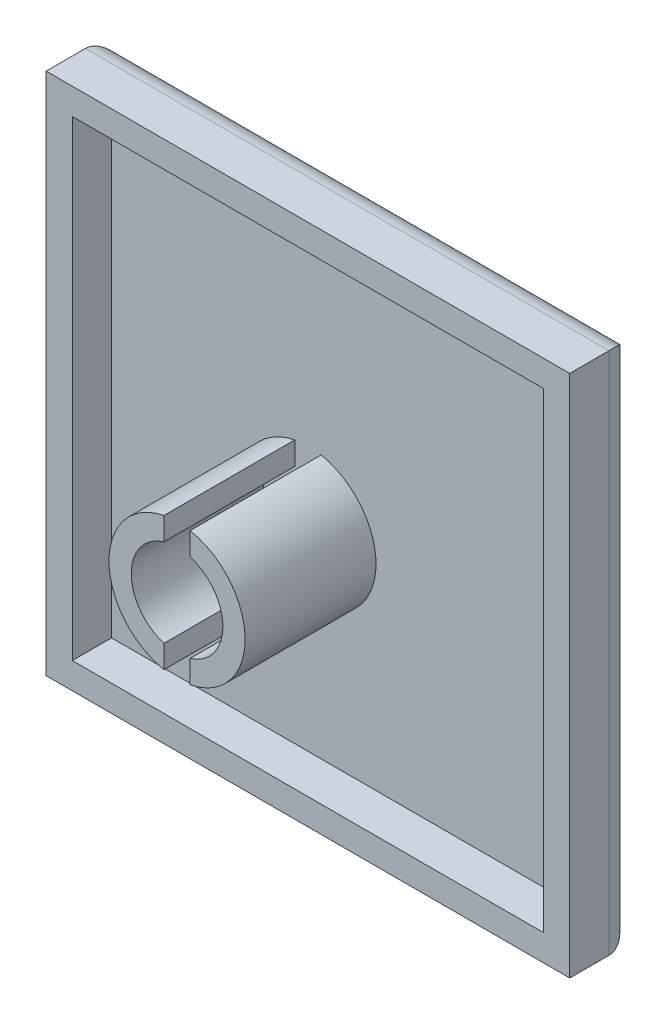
ISO-10303-21;
HEADER;
FILE_DESCRIPTION(('STEP AP214'),'2;1');
FILE_NAME('part.step','',(''),(''),'','','');
FILE_SCHEMA(('AUTOMOTIVE_DESIGN { 1 0 10303 214 1 1 1 1 }'));
ENDSEC;
DATA;
#1=APPLICATION_CONTEXT('core data for automotive mechanical design processes');
#2=APPLICATION_PROTOCOL_DEFINITION('international standard','automotive_design',2000,#1);
#3=PRODUCT_CONTEXT('',#1,'mechanical');
#4=PRODUCT('Part','Part','',(#3));
#5=PRODUCT_RELATED_PRODUCT_CATEGORY('part','',(#4));
#6=PRODUCT_DEFINITION_FORMATION('','',#4);
#7=PRODUCT_DEFINITION_CONTEXT('part definition',#1,'design');
#8=PRODUCT_DEFINITION('design','',#6,#7);
#9=PRODUCT_DEFINITION_SHAPE('','',#8);
#10=(LENGTH_UNIT() NAMED_UNIT(*) SI_UNIT(.MILLI.,.METRE.));
#11=(NAMED_UNIT(*) PLANE_ANGLE_UNIT() SI_UNIT($,.RADIAN.));
#12=(NAMED_UNIT(*) SI_UNIT($,.STERADIAN.) SOLID_ANGLE_UNIT());
#13=UNCERTAINTY_MEASURE_WITH_UNIT(LENGTH_MEASURE(1.E-05),#10,'distance_accuracy_value','');
#14=(GEOMETRIC_REPRESENTATION_CONTEXT(3) GLOBAL_UNCERTAINTY_ASSIGNED_CONTEXT((#13)) GLOBAL_UNIT_ASSIGNED_CONTEXT((#10,
#11,#12)) REPRESENTATION_CONTEXT('',''));
#15=CARTESIAN_POINT('',(0.,0.,0.));
#16=DIRECTION('',(0.,0.,1.));
#17=DIRECTION('',(1.,0.,0.));
#18=AXIS2_PLACEMENT_3D('',#15,#16,#17);
#19=CARTESIAN_POINT('',(0.,0.,6.25));
#20=DIRECTION('',(0.,0.,1.));
#21=DIRECTION('',(1.,0.,0.));
#22=AXIS2_PLACEMENT_3D('',#19,#20,#21);
#23=PLANE('',#22);
#24=DIRECTION('',(0.,-1.,0.));
#25=VECTOR('',#24,1.);
#26=CARTESIAN_POINT('',(-0.500000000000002,10.,6.25));
#27=LINE('',#26,#25);
#28=CARTESIAN_POINT('',(-0.500000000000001,2.55147016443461,6.25));
#29=VERTEX_POINT('',#28);
#30=CARTESIAN_POINT('',(-0.500000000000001,1.67705098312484,6.25));
#31=VERTEX_POINT('',#30);
#32=EDGE_CURVE('E55',#29,#31,#27,.T.);
#33=ORIENTED_EDGE('',*,*,#32,.F.);
#34=CARTESIAN_POINT('',(0.,0.,6.25));
#35=DIRECTION('',(0.,0.,1.));
#36=DIRECTION('',(1.,0.,0.));
#37=AXIS2_PLACEMENT_3D('',#34,#35,#36);
#38=CIRCLE('',#37,2.6);
#39=CARTESIAN_POINT('',(-0.5,-2.55147016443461,6.25));
#40=VERTEX_POINT('',#39);
#41=EDGE_CURVE('E100',#29,#40,#38,.T.);
#42=ORIENTED_EDGE('',*,*,#41,.T.);
#43=CARTESIAN_POINT('',(-0.500000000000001,-1.67705098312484,6.25));
#44=VERTEX_POINT('',#43);
#45=EDGE_CURVE('E13',#44,#40,#27,.T.);
#46=ORIENTED_EDGE('',*,*,#45,.F.);
#47=CARTESIAN_POINT('',(0.,0.,6.25));
#48=DIRECTION('',(0.,0.,1.));
#49=DIRECTION('',(1.,0.,0.));
#50=AXIS2_PLACEMENT_3D('',#47,#48,#49);
#51=CIRCLE('',#50,1.75);
#52=EDGE_CURVE('E49',#31,#44,#51,.T.);
#53=ORIENTED_EDGE('',*,*,#52,.F.);
#54=EDGE_LOOP('',(#33,#42,#46,#53));
#55=FACE_BOUND('',#54,.T.);
#56=ADVANCED_FACE('F46',(#55),#23,.T.);
#57=CARTESIAN_POINT('',(0.,0.,6.25));
#58=DIRECTION('',(0.,0.,-1.));
#59=DIRECTION('',(-1.,0.,0.));
#60=AXIS2_PLACEMENT_3D('',#57,#58,#59);
#61=CYLINDRICAL_SURFACE('',#60,2.6);
#62=ORIENTED_EDGE('',*,*,#41,.F.);
#63=DIRECTION('',(0.,0.,-1.));
#64=VECTOR('',#63,1.);
#65=CARTESIAN_POINT('',(-0.500000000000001,2.55147016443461,6.25));
#66=LINE('',#65,#64);
#67=CARTESIAN_POINT('',(-0.5,2.55147016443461,1.25));
#68=VERTEX_POINT('',#67);
#69=EDGE_CURVE('E111',#29,#68,#66,.T.);
#70=ORIENTED_EDGE('',*,*,#69,.T.);
#71=CARTESIAN_POINT('',(0.,0.,1.25));
#72=DIRECTION('',(0.,0.,1.));
#73=DIRECTION('',(1.,0.,0.));
#74=AXIS2_PLACEMENT_3D('',#71,#72,#73);
#75=CIRCLE('',#74,2.6);
#76=CARTESIAN_POINT('',(-0.5,-2.55147016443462,1.25));
#77=VERTEX_POINT('',#76);
#78=EDGE_CURVE('E112',#68,#77,#75,.T.);
#79=ORIENTED_EDGE('',*,*,#78,.T.);
#80=DIRECTION('',(0.,0.,-1.));
#81=VECTOR('',#80,1.);
#82=CARTESIAN_POINT('',(-0.5,-2.55147016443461,6.25));
#83=LINE('',#82,#81);
#84=EDGE_CURVE('E63',#77,#40,#83,.F.);
#85=ORIENTED_EDGE('',*,*,#84,.T.);
#86=EDGE_LOOP('',(#62,#70,#79,#85));
#87=FACE_BOUND('',#86,.T.);
#88=ADVANCED_FACE('F116',(#87),#61,.T.);
#89=CARTESIAN_POINT('',(0.,0.,1.25));
#90=DIRECTION('',(0.,0.,1.));
#91=DIRECTION('',(1.,0.,0.));
#92=AXIS2_PLACEMENT_3D('',#89,#90,#91);
#93=PLANE('',#92);
#94=ORIENTED_EDGE('',*,*,#78,.F.);
#95=DIRECTION('',(0.,-1.,0.));
#96=VECTOR('',#95,1.);
#97=CARTESIAN_POINT('',(-0.500000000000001,10.,1.25));
#98=LINE('',#97,#96);
#99=CARTESIAN_POINT('',(-0.5,1.67705098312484,1.25));
#100=VERTEX_POINT('',#99);
#101=EDGE_CURVE('E102',#68,#100,#98,.T.);
#102=ORIENTED_EDGE('',*,*,#101,.T.);
#103=CARTESIAN_POINT('',(0.,0.,1.25));
#104=DIRECTION('',(0.,0.,1.));
#105=DIRECTION('',(1.,0.,0.));
#106=AXIS2_PLACEMENT_3D('',#103,#104,#105);
#107=CIRCLE('',#106,1.75);
#108=CARTESIAN_POINT('',(-0.5,-1.67705098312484,1.25));
#109=VERTEX_POINT('',#108);
#110=EDGE_CURVE('E94',#109,#100,#107,.F.);
#111=ORIENTED_EDGE('',*,*,#110,.F.);
#112=EDGE_CURVE('E89',#109,#77,#98,.T.);
#113=ORIENTED_EDGE('',*,*,#112,.T.);
#114=EDGE_LOOP('',(#94,#102,#111,#113));
#115=FACE_BOUND('',#114,.T.);
#116=ADVANCED_FACE('F117',(#115),#93,.F.);
#117=CARTESIAN_POINT('',(0.,0.,-5.19974746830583));
#118=DIRECTION('',(0.,0.,1.));
#119=DIRECTION('',(1.,0.,0.));
#120=AXIS2_PLACEMENT_3D('',#117,#118,#119);
#121=CYLINDRICAL_SURFACE('',#120,1.75);
#122=ORIENTED_EDGE('',*,*,#52,.T.);
#123=DIRECTION('',(0.,0.,1.));
#124=VECTOR('',#123,1.);
#125=CARTESIAN_POINT('',(-0.499999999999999,-1.67705098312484,-5.19974746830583));
#126=LINE('',#125,#124);
#127=EDGE_CURVE('E86',#44,#109,#126,.F.);
#128=ORIENTED_EDGE('',*,*,#127,.T.);
#129=ORIENTED_EDGE('',*,*,#110,.T.);
#130=DIRECTION('',(0.,0.,1.));
#131=VECTOR('',#130,1.);
#132=CARTESIAN_POINT('',(-0.499999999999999,1.67705098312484,-5.19974746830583));
#133=LINE('',#132,#131);
#134=EDGE_CURVE('E77',#100,#31,#133,.T.);
#135=ORIENTED_EDGE('',*,*,#134,.T.);
#136=EDGE_LOOP('',(#122,#128,#129,#135));
#137=FACE_BOUND('',#136,.T.);
#138=ADVANCED_FACE('F101',(#137),#121,.F.);
#139=CARTESIAN_POINT('',(-0.500000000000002,10.,6.25));
#140=DIRECTION('',(-1.,0.,0.));
#141=DIRECTION('',(0.,0.,1.));
#142=AXIS2_PLACEMENT_3D('',#139,#140,#141);
#143=PLANE('',#142);
#144=ORIENTED_EDGE('',*,*,#32,.T.);
#145=ORIENTED_EDGE('',*,*,#134,.F.);
#146=ORIENTED_EDGE('',*,*,#101,.F.);
#147=ORIENTED_EDGE('',*,*,#69,.F.);
#148=EDGE_LOOP('',(#144,#145,#146,#147));
#149=FACE_BOUND('',#148,.T.);
#150=ADVANCED_FACE('F118',(#149),#143,.F.);
#151=ORIENTED_EDGE('',*,*,#112,.F.);
#152=ORIENTED_EDGE('',*,*,#127,.F.);
#153=ORIENTED_EDGE('',*,*,#45,.T.);
#154=ORIENTED_EDGE('',*,*,#84,.F.);
#155=EDGE_LOOP('',(#151,#152,#153,#154));
#156=FACE_BOUND('',#155,.T.);
#157=ADVANCED_FACE('F88',(#156),#143,.F.);
#158=CLOSED_SHELL('',(#56,#88,#116,#138,#150,#157));
#159=MANIFOLD_SOLID_BREP('B2',#158);
#160=CARTESIAN_POINT('',(0.,0.,1.25));
#161=DIRECTION('',(0.,0.,1.));
#162=DIRECTION('',(1.,0.,0.));
#163=AXIS2_PLACEMENT_3D('',#160,#161,#162);
#164=PLANE('',#163);
#165=DIRECTION('',(0.,-1.,0.));
#166=VECTOR('',#165,1.);
#167=CARTESIAN_POINT('',(-9.,9.00000000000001,1.25));
#168=LINE('',#167,#166);
#169=CARTESIAN_POINT('',(-9.,9.00000000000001,1.25));
#170=VERTEX_POINT('',#169);
#171=CARTESIAN_POINT('',(-9.,-8.99999999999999,1.25));
#172=VERTEX_POINT('',#171);
#173=EDGE_CURVE('E254',#170,#172,#168,.T.);
#174=ORIENTED_EDGE('',*,*,#173,.F.);
#175=DIRECTION('',(-1.,0.,0.));
#176=VECTOR('',#175,1.);
#177=CARTESIAN_POINT('',(-9.,9.00000000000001,1.25));
#178=LINE('',#177,#176);
#179=CARTESIAN_POINT('',(9.,9.00000000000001,1.25));
#180=VERTEX_POINT('',#179);
#181=EDGE_CURVE('E286',#180,#170,#178,.T.);
#182=ORIENTED_EDGE('',*,*,#181,.F.);
#183=DIRECTION('',(0.,1.,0.));
#184=VECTOR('',#183,1.);
#185=CARTESIAN_POINT('',(9.,9.00000000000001,1.25));
#186=LINE('',#185,#184);
#187=CARTESIAN_POINT('',(9.,-8.99999999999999,1.25));
#188=VERTEX_POINT('',#187);
#189=EDGE_CURVE('E283',#188,#180,#186,.T.);
#190=ORIENTED_EDGE('',*,*,#189,.F.);
#191=DIRECTION('',(1.,0.,0.));
#192=VECTOR('',#191,1.);
#193=CARTESIAN_POINT('',(-9.,-8.99999999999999,1.25));
#194=LINE('',#193,#192);
#195=EDGE_CURVE('E262',#172,#188,#194,.T.);
#196=ORIENTED_EDGE('',*,*,#195,.F.);
#197=EDGE_LOOP('',(#174,#182,#190,#196));
#198=FACE_BOUND('',#197,.T.);
#199=DIRECTION('',(-1.,0.,0.));
#200=VECTOR('',#199,1.);
#201=CARTESIAN_POINT('',(-10.,10.,1.25));
#202=LINE('',#201,#200);
#203=CARTESIAN_POINT('',(10.,10.,1.25));
#204=VERTEX_POINT('',#203);
#205=CARTESIAN_POINT('',(-10.,10.,1.25));
#206=VERTEX_POINT('',#205);
#207=EDGE_CURVE('E181',#204,#206,#202,.T.);
#208=ORIENTED_EDGE('',*,*,#207,.T.);
#209=DIRECTION('',(0.,-1.,0.));
#210=VECTOR('',#209,1.);
#211=CARTESIAN_POINT('',(-10.,10.,1.25));
#212=LINE('',#211,#210);
#213=CARTESIAN_POINT('',(-10.,-9.99999999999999,1.25));
#214=VERTEX_POINT('',#213);
#215=EDGE_CURVE('E276',#206,#214,#212,.T.);
#216=ORIENTED_EDGE('',*,*,#215,.T.);
#217=DIRECTION('',(1.,0.,0.));
#218=VECTOR('',#217,1.);
#219=CARTESIAN_POINT('',(-10.,-9.99999999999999,1.25));
#220=LINE('',#219,#218);
#221=CARTESIAN_POINT('',(10.,-9.99999999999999,1.25));
#222=VERTEX_POINT('',#221);
#223=EDGE_CURVE('E273',#214,#222,#220,.T.);
#224=ORIENTED_EDGE('',*,*,#223,.T.);
#225=DIRECTION('',(0.,1.,0.));
#226=VECTOR('',#225,1.);
#227=CARTESIAN_POINT('',(10.,10.,1.25));
#228=LINE('',#227,#226);
#229=EDGE_CURVE('E275',#222,#204,#228,.T.);
#230=ORIENTED_EDGE('',*,*,#229,.T.);
#231=EDGE_LOOP('',(#208,#216,#224,#230));
#232=FACE_BOUND('',#231,.T.);
#233=ADVANCED_FACE('F177',(#198,#232),#164,.T.);
#234=CARTESIAN_POINT('',(-10.,10.,1.25));
#235=DIRECTION('',(1.,0.,0.));
#236=DIRECTION('',(0.,1.,0.));
#237=AXIS2_PLACEMENT_3D('',#234,#235,#236);
#238=PLANE('',#237);
#239=DIRECTION('',(0.,0.,-1.));
#240=VECTOR('',#239,1.);
#241=CARTESIAN_POINT('',(-10.,10.,1.25));
#242=LINE('',#241,#240);
#243=CARTESIAN_POINT('',(-10.,10.,-0.25));
#244=VERTEX_POINT('',#243);
#245=EDGE_CURVE('E390',#206,#244,#242,.T.);
#246=ORIENTED_EDGE('',*,*,#245,.T.);
#247=DIRECTION('',(0.,-1.,0.));
#248=VECTOR('',#247,1.);
#249=CARTESIAN_POINT('',(-10.,10.,-0.25));
#250=LINE('',#249,#248);
#251=CARTESIAN_POINT('',(-10.,-9.99999999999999,-0.25));
#252=VERTEX_POINT('',#251);
#253=EDGE_CURVE('E387',#244,#252,#250,.T.);
#254=ORIENTED_EDGE('',*,*,#253,.T.);
#255=DIRECTION('',(0.,0.,-1.));
#256=VECTOR('',#255,1.);
#257=CARTESIAN_POINT('',(-10.,-9.99999999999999,1.25));
#258=LINE('',#257,#256);
#259=EDGE_CURVE('E389',#214,#252,#258,.T.);
#260=ORIENTED_EDGE('',*,*,#259,.F.);
#261=ORIENTED_EDGE('',*,*,#215,.F.);
#262=EDGE_LOOP('',(#246,#254,#260,#261));
#263=FACE_BOUND('',#262,.T.);
#264=ADVANCED_FACE('F310',(#263),#238,.F.);
#265=CARTESIAN_POINT('',(-10.,-9.99999999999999,1.25));
#266=DIRECTION('',(0.,1.,0.));
#267=DIRECTION('',(-1.,0.,0.));
#268=AXIS2_PLACEMENT_3D('',#265,#266,#267);
#269=PLANE('',#268);
#270=ORIENTED_EDGE('',*,*,#259,.T.);
#271=DIRECTION('',(1.,0.,0.));
#272=VECTOR('',#271,1.);
#273=CARTESIAN_POINT('',(-10.,-9.99999999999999,-0.25));
#274=LINE('',#273,#272);
#275=CARTESIAN_POINT('',(10.,-9.99999999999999,-0.25));
#276=VERTEX_POINT('',#275);
#277=EDGE_CURVE('E398',#252,#276,#274,.T.);
#278=ORIENTED_EDGE('',*,*,#277,.T.);
#279=DIRECTION('',(0.,0.,-1.));
#280=VECTOR('',#279,1.);
#281=CARTESIAN_POINT('',(10.,-9.99999999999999,1.25));
#282=LINE('',#281,#280);
#283=EDGE_CURVE('E385',#222,#276,#282,.T.);
#284=ORIENTED_EDGE('',*,*,#283,.F.);
#285=ORIENTED_EDGE('',*,*,#223,.F.);
#286=EDGE_LOOP('',(#270,#278,#284,#285));
#287=FACE_BOUND('',#286,.T.);
#288=ADVANCED_FACE('F315',(#287),#269,.F.);
#289=CARTESIAN_POINT('',(10.,10.,1.25));
#290=DIRECTION('',(-1.,0.,0.));
#291=DIRECTION('',(0.,-1.,0.));
#292=AXIS2_PLACEMENT_3D('',#289,#290,#291);
#293=PLANE('',#292);
#294=ORIENTED_EDGE('',*,*,#283,.T.);
#295=DIRECTION('',(0.,1.,0.));
#296=VECTOR('',#295,1.);
#297=CARTESIAN_POINT('',(10.,10.,-0.25));
#298=LINE('',#297,#296);
#299=CARTESIAN_POINT('',(10.,10.,-0.25));
#300=VERTEX_POINT('',#299);
#301=EDGE_CURVE('E361',#276,#300,#298,.T.);
#302=ORIENTED_EDGE('',*,*,#301,.T.);
#303=DIRECTION('',(0.,0.,-1.));
#304=VECTOR('',#303,1.);
#305=CARTESIAN_POINT('',(10.,10.,1.25));
#306=LINE('',#305,#304);
#307=EDGE_CURVE('E355',#204,#300,#306,.T.);
#308=ORIENTED_EDGE('',*,*,#307,.F.);
#309=ORIENTED_EDGE('',*,*,#229,.F.);
#310=EDGE_LOOP('',(#294,#302,#308,#309));
#311=FACE_BOUND('',#310,.T.);
#312=ADVANCED_FACE('F340',(#311),#293,.F.);
#313=CARTESIAN_POINT('',(-10.,10.,1.25));
#314=DIRECTION('',(0.,-1.,0.));
#315=DIRECTION('',(1.,0.,0.));
#316=AXIS2_PLACEMENT_3D('',#313,#314,#315);
#317=PLANE('',#316);
#318=ORIENTED_EDGE('',*,*,#307,.T.);
#319=DIRECTION('',(-1.,0.,0.));
#320=VECTOR('',#319,1.);
#321=CARTESIAN_POINT('',(-10.,10.,-0.25));
#322=LINE('',#321,#320);
#323=EDGE_CURVE('E358',#300,#244,#322,.T.);
#324=ORIENTED_EDGE('',*,*,#323,.T.);
#325=ORIENTED_EDGE('',*,*,#245,.F.);
#326=ORIENTED_EDGE('',*,*,#207,.F.);
#327=EDGE_LOOP('',(#318,#324,#325,#326));
#328=FACE_BOUND('',#327,.T.);
#329=ADVANCED_FACE('F343',(#328),#317,.F.);
#330=CARTESIAN_POINT('',(0.,0.,-1.25));
#331=DIRECTION('',(0.,0.,1.));
#332=DIRECTION('',(1.,0.,0.));
#333=AXIS2_PLACEMENT_3D('',#330,#331,#332);
#334=PLANE('',#333);
#335=DIRECTION('',(0.,1.,0.));
#336=VECTOR('',#335,1.);
#337=CARTESIAN_POINT('',(9.,0.,-1.25));
#338=LINE('',#337,#336);
#339=CARTESIAN_POINT('',(9.,9.,-1.25));
#340=VERTEX_POINT('',#339);
#341=CARTESIAN_POINT('',(9.,-8.99999999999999,-1.25));
#342=VERTEX_POINT('',#341);
#343=EDGE_CURVE('E373',#340,#342,#338,.F.);
#344=ORIENTED_EDGE('',*,*,#343,.T.);
#345=DIRECTION('',(1.,0.,0.));
#346=VECTOR('',#345,1.);
#347=CARTESIAN_POINT('',(0.,-8.99999999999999,-1.25));
#348=LINE('',#347,#346);
#349=CARTESIAN_POINT('',(-9.,-8.99999999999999,-1.25));
#350=VERTEX_POINT('',#349);
#351=EDGE_CURVE('E391',#342,#350,#348,.F.);
#352=ORIENTED_EDGE('',*,*,#351,.T.);
#353=DIRECTION('',(0.,-1.,0.));
#354=VECTOR('',#353,1.);
#355=CARTESIAN_POINT('',(-9.,0.,-1.25));
#356=LINE('',#355,#354);
#357=CARTESIAN_POINT('',(-9.,9.00000000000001,-1.25));
#358=VERTEX_POINT('',#357);
#359=EDGE_CURVE('E394',#350,#358,#356,.F.);
#360=ORIENTED_EDGE('',*,*,#359,.T.);
#361=DIRECTION('',(-1.,0.,0.));
#362=VECTOR('',#361,1.);
#363=CARTESIAN_POINT('',(0.,9.,-1.25));
#364=LINE('',#363,#362);
#365=EDGE_CURVE('E381',#358,#340,#364,.F.);
#366=ORIENTED_EDGE('',*,*,#365,.T.);
#367=EDGE_LOOP('',(#344,#352,#360,#366));
#368=FACE_BOUND('',#367,.T.);
#369=ADVANCED_FACE('F320',(#368),#334,.F.);
#370=CARTESIAN_POINT('',(-10.,9.00000000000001,-0.25));
#371=DIRECTION('',(-1.,0.,0.));
#372=DIRECTION('',(0.,-1.,0.));
#373=AXIS2_PLACEMENT_3D('',#370,#371,#372);
#374=CYLINDRICAL_SURFACE('',#373,1.);
#375=CARTESIAN_POINT('',(9.,9.,-0.25));
#376=DIRECTION('',(-0.707106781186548,0.707106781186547,0.));
#377=DIRECTION('',(0.707106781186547,0.707106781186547,0.));
#378=AXIS2_PLACEMENT_3D('',#375,#376,#377);
#379=ELLIPSE('',#378,1.41421356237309,1.);
#380=EDGE_CURVE('E368',#340,#300,#379,.F.);
#381=ORIENTED_EDGE('',*,*,#380,.F.);
#382=ORIENTED_EDGE('',*,*,#365,.F.);
#383=CARTESIAN_POINT('',(-9.,9.00000000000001,-0.25));
#384=DIRECTION('',(-0.707106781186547,-0.707106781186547,0.));
#385=DIRECTION('',(-0.707106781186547,0.707106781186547,0.));
#386=AXIS2_PLACEMENT_3D('',#383,#384,#385);
#387=ELLIPSE('',#386,1.4142135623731,1.);
#388=EDGE_CURVE('E371',#244,#358,#387,.T.);
#389=ORIENTED_EDGE('',*,*,#388,.F.);
#390=ORIENTED_EDGE('',*,*,#323,.F.);
#391=EDGE_LOOP('',(#381,#382,#389,#390));
#392=FACE_BOUND('',#391,.T.);
#393=ADVANCED_FACE('F350',(#392),#374,.T.);
#394=CARTESIAN_POINT('',(-9.,10.,-0.25));
#395=DIRECTION('',(0.,-1.,0.));
#396=DIRECTION('',(1.,0.,0.));
#397=AXIS2_PLACEMENT_3D('',#394,#395,#396);
#398=CYLINDRICAL_SURFACE('',#397,1.);
#399=ORIENTED_EDGE('',*,*,#388,.T.);
#400=ORIENTED_EDGE('',*,*,#359,.F.);
#401=CARTESIAN_POINT('',(-9.,-8.99999999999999,-0.25));
#402=DIRECTION('',(0.707106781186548,-0.707106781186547,0.));
#403=DIRECTION('',(-0.707106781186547,-0.707106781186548,0.));
#404=AXIS2_PLACEMENT_3D('',#401,#402,#403);
#405=ELLIPSE('',#404,1.41421356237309,1.);
#406=EDGE_CURVE('E378',#252,#350,#405,.T.);
#407=ORIENTED_EDGE('',*,*,#406,.F.);
#408=ORIENTED_EDGE('',*,*,#253,.F.);
#409=EDGE_LOOP('',(#399,#400,#407,#408));
#410=FACE_BOUND('',#409,.T.);
#411=ADVANCED_FACE('F333',(#410),#398,.T.);
#412=CARTESIAN_POINT('',(9.,10.,-0.25));
#413=DIRECTION('',(0.,1.,0.));
#414=DIRECTION('',(-1.,0.,0.));
#415=AXIS2_PLACEMENT_3D('',#412,#413,#414);
#416=CYLINDRICAL_SURFACE('',#415,1.);
#417=ORIENTED_EDGE('',*,*,#380,.T.);
#418=ORIENTED_EDGE('',*,*,#301,.F.);
#419=CARTESIAN_POINT('',(9.,-8.99999999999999,-0.25));
#420=DIRECTION('',(0.707106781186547,0.707106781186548,0.));
#421=DIRECTION('',(-0.707106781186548,0.707106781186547,0.));
#422=AXIS2_PLACEMENT_3D('',#419,#420,#421);
#423=ELLIPSE('',#422,1.4142135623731,1.);
#424=EDGE_CURVE('E293',#342,#276,#423,.F.);
#425=ORIENTED_EDGE('',*,*,#424,.F.);
#426=ORIENTED_EDGE('',*,*,#343,.F.);
#427=EDGE_LOOP('',(#417,#418,#425,#426));
#428=FACE_BOUND('',#427,.T.);
#429=ADVANCED_FACE('F327',(#428),#416,.T.);
#430=CARTESIAN_POINT('',(-10.,-8.99999999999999,-0.25));
#431=DIRECTION('',(1.,0.,0.));
#432=DIRECTION('',(0.,1.,0.));
#433=AXIS2_PLACEMENT_3D('',#430,#431,#432);
#434=CYLINDRICAL_SURFACE('',#433,1.);
#435=ORIENTED_EDGE('',*,*,#406,.T.);
#436=ORIENTED_EDGE('',*,*,#351,.F.);
#437=ORIENTED_EDGE('',*,*,#424,.T.);
#438=ORIENTED_EDGE('',*,*,#277,.F.);
#439=EDGE_LOOP('',(#435,#436,#437,#438));
#440=FACE_BOUND('',#439,.T.);
#441=ADVANCED_FACE('F323',(#440),#434,.T.);
#442=CARTESIAN_POINT('',(-9.,9.00000000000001,-0.25));
#443=DIRECTION('',(-1.,0.,0.));
#444=DIRECTION('',(0.,0.,1.));
#445=AXIS2_PLACEMENT_3D('',#442,#443,#444);
#446=PLANE('',#445);
#447=ORIENTED_EDGE('',*,*,#173,.T.);
#448=DIRECTION('',(0.,0.,1.));
#449=VECTOR('',#448,1.);
#450=CARTESIAN_POINT('',(-9.,-8.99999999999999,-0.25));
#451=LINE('',#450,#449);
#452=CARTESIAN_POINT('',(-9.,-8.99999999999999,-0.25));
#453=VERTEX_POINT('',#452);
#454=EDGE_CURVE('E257',#453,#172,#451,.T.);
#455=ORIENTED_EDGE('',*,*,#454,.F.);
#456=DIRECTION('',(0.,-1.,0.));
#457=VECTOR('',#456,1.);
#458=CARTESIAN_POINT('',(-9.,9.00000000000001,-0.25));
#459=LINE('',#458,#457);
#460=CARTESIAN_POINT('',(-9.,9.00000000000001,-0.25));
#461=VERTEX_POINT('',#460);
#462=EDGE_CURVE('E260',#461,#453,#459,.T.);
#463=ORIENTED_EDGE('',*,*,#462,.F.);
#464=DIRECTION('',(0.,0.,1.));
#465=VECTOR('',#464,1.);
#466=CARTESIAN_POINT('',(-9.,9.00000000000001,-0.25));
#467=LINE('',#466,#465);
#468=EDGE_CURVE('E287',#461,#170,#467,.T.);
#469=ORIENTED_EDGE('',*,*,#468,.T.);
#470=EDGE_LOOP('',(#447,#455,#463,#469));
#471=FACE_BOUND('',#470,.T.);
#472=ADVANCED_FACE('F258',(#471),#446,.F.);
#473=CARTESIAN_POINT('',(-9.,9.00000000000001,-0.25));
#474=DIRECTION('',(0.,1.,0.));
#475=DIRECTION('',(-1.,0.,0.));
#476=AXIS2_PLACEMENT_3D('',#473,#474,#475);
#477=PLANE('',#476);
#478=ORIENTED_EDGE('',*,*,#181,.T.);
#479=ORIENTED_EDGE('',*,*,#468,.F.);
#480=DIRECTION('',(-1.,0.,0.));
#481=VECTOR('',#480,1.);
#482=CARTESIAN_POINT('',(-9.,9.00000000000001,-0.25));
#483=LINE('',#482,#481);
#484=CARTESIAN_POINT('',(9.,9.00000000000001,-0.25));
#485=VERTEX_POINT('',#484);
#486=EDGE_CURVE('E44',#485,#461,#483,.T.);
#487=ORIENTED_EDGE('',*,*,#486,.F.);
#488=DIRECTION('',(0.,0.,1.));
#489=VECTOR('',#488,1.);
#490=CARTESIAN_POINT('',(9.,9.00000000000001,-0.25));
#491=LINE('',#490,#489);
#492=EDGE_CURVE('E284',#485,#180,#491,.T.);
#493=ORIENTED_EDGE('',*,*,#492,.T.);
#494=EDGE_LOOP('',(#478,#479,#487,#493));
#495=FACE_BOUND('',#494,.T.);
#496=ADVANCED_FACE('F296',(#495),#477,.F.);
#497=CARTESIAN_POINT('',(9.,9.00000000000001,-0.25));
#498=DIRECTION('',(1.,0.,0.));
#499=DIRECTION('',(0.,1.,0.));
#500=AXIS2_PLACEMENT_3D('',#497,#498,#499);
#501=PLANE('',#500);
#502=ORIENTED_EDGE('',*,*,#189,.T.);
#503=ORIENTED_EDGE('',*,*,#492,.F.);
#504=DIRECTION('',(0.,1.,0.));
#505=VECTOR('',#504,1.);
#506=CARTESIAN_POINT('',(9.,9.00000000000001,-0.25));
#507=LINE('',#506,#505);
#508=CARTESIAN_POINT('',(9.,-8.99999999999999,-0.25));
#509=VERTEX_POINT('',#508);
#510=EDGE_CURVE('E188',#509,#485,#507,.T.);
#511=ORIENTED_EDGE('',*,*,#510,.F.);
#512=DIRECTION('',(0.,0.,1.));
#513=VECTOR('',#512,1.);
#514=CARTESIAN_POINT('',(9.,-8.99999999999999,-0.25));
#515=LINE('',#514,#513);
#516=EDGE_CURVE('E196',#509,#188,#515,.T.);
#517=ORIENTED_EDGE('',*,*,#516,.T.);
#518=EDGE_LOOP('',(#502,#503,#511,#517));
#519=FACE_BOUND('',#518,.T.);
#520=ADVANCED_FACE('F301',(#519),#501,.F.);
#521=CARTESIAN_POINT('',(-9.,-8.99999999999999,-0.25));
#522=DIRECTION('',(0.,-1.,0.));
#523=DIRECTION('',(0.,0.,-1.));
#524=AXIS2_PLACEMENT_3D('',#521,#522,#523);
#525=PLANE('',#524);
#526=ORIENTED_EDGE('',*,*,#195,.T.);
#527=ORIENTED_EDGE('',*,*,#516,.F.);
#528=DIRECTION('',(1.,0.,0.));
#529=VECTOR('',#528,1.);
#530=CARTESIAN_POINT('',(-9.,-8.99999999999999,-0.25));
#531=LINE('',#530,#529);
#532=EDGE_CURVE('E265',#453,#509,#531,.T.);
#533=ORIENTED_EDGE('',*,*,#532,.F.);
#534=ORIENTED_EDGE('',*,*,#454,.T.);
#535=EDGE_LOOP('',(#526,#527,#533,#534));
#536=FACE_BOUND('',#535,.T.);
#537=ADVANCED_FACE('F266',(#536),#525,.F.);
#538=CARTESIAN_POINT('',(0.,0.,-0.25));
#539=DIRECTION('',(0.,0.,1.));
#540=DIRECTION('',(1.,0.,0.));
#541=AXIS2_PLACEMENT_3D('',#538,#539,#540);
#542=PLANE('',#541);
#543=ORIENTED_EDGE('',*,*,#462,.T.);
#544=ORIENTED_EDGE('',*,*,#532,.T.);
#545=ORIENTED_EDGE('',*,*,#510,.T.);
#546=ORIENTED_EDGE('',*,*,#486,.T.);
#547=EDGE_LOOP('',(#543,#544,#545,#546));
#548=FACE_BOUND('',#547,.T.);
#549=ADVANCED_FACE('F179',(#548),#542,.T.);
#550=CLOSED_SHELL('',(#233,#264,#288,#312,#329,#369,#393,#411,#429,#441,#472,#496,#520,#537,#549));
#551=MANIFOLD_SOLID_BREP('B7',#550);
#552=CARTESIAN_POINT('',(0.,0.,-5.19974746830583));
#553=DIRECTION('',(0.,0.,1.));
#554=DIRECTION('',(1.,0.,0.));
#555=AXIS2_PLACEMENT_3D('',#552,#553,#554);
#556=CYLINDRICAL_SURFACE('',#555,1.75);
#557=CARTESIAN_POINT('',(0.,0.,6.25));
#558=DIRECTION('',(0.,0.,1.));
#559=DIRECTION('',(1.,0.,0.));
#560=AXIS2_PLACEMENT_3D('',#557,#558,#559);
#561=CIRCLE('',#560,1.75);
#562=CARTESIAN_POINT('',(0.499999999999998,-1.67705098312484,6.25));
#563=VERTEX_POINT('',#562);
#564=CARTESIAN_POINT('',(0.499999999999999,1.67705098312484,6.25));
#565=VERTEX_POINT('',#564);
#566=EDGE_CURVE('E562',#563,#565,#561,.T.);
#567=ORIENTED_EDGE('',*,*,#566,.T.);
#568=DIRECTION('',(0.,0.,1.));
#569=VECTOR('',#568,1.);
#570=CARTESIAN_POINT('',(0.499999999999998,1.67705098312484,-5.19974746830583));
#571=LINE('',#570,#569);
#572=CARTESIAN_POINT('',(0.499999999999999,1.67705098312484,1.25));
#573=VERTEX_POINT('',#572);
#574=EDGE_CURVE('E175',#565,#573,#571,.F.);
#575=ORIENTED_EDGE('',*,*,#574,.T.);
#576=CARTESIAN_POINT('',(0.,0.,1.25));
#577=DIRECTION('',(0.,0.,1.));
#578=DIRECTION('',(1.,0.,0.));
#579=AXIS2_PLACEMENT_3D('',#576,#577,#578);
#580=CIRCLE('',#579,1.75);
#581=CARTESIAN_POINT('',(0.499999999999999,-1.67705098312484,1.25));
#582=VERTEX_POINT('',#581);
#583=EDGE_CURVE('E555',#573,#582,#580,.F.);
#584=ORIENTED_EDGE('',*,*,#583,.T.);
#585=DIRECTION('',(0.,0.,1.));
#586=VECTOR('',#585,1.);
#587=CARTESIAN_POINT('',(0.499999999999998,-1.67705098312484,-5.19974746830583));
#588=LINE('',#587,#586);
#589=EDGE_CURVE('E508',#582,#563,#588,.T.);
#590=ORIENTED_EDGE('',*,*,#589,.T.);
#591=EDGE_LOOP('',(#567,#575,#584,#590));
#592=FACE_BOUND('',#591,.T.);
#593=ADVANCED_FACE('F500',(#592),#556,.F.);
#594=CARTESIAN_POINT('',(0.,0.,1.25));
#595=DIRECTION('',(0.,0.,1.));
#596=DIRECTION('',(1.,0.,0.));
#597=AXIS2_PLACEMENT_3D('',#594,#595,#596);
#598=PLANE('',#597);
#599=CARTESIAN_POINT('',(0.,0.,1.25));
#600=DIRECTION('',(0.,0.,1.));
#601=DIRECTION('',(1.,0.,0.));
#602=AXIS2_PLACEMENT_3D('',#599,#600,#601);
#603=CIRCLE('',#602,2.6);
#604=CARTESIAN_POINT('',(0.499999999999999,-2.55147016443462,1.25));
#605=VERTEX_POINT('',#604);
#606=CARTESIAN_POINT('',(0.499999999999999,2.55147016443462,1.25));
#607=VERTEX_POINT('',#606);
#608=EDGE_CURVE('E553',#605,#607,#603,.T.);
#609=ORIENTED_EDGE('',*,*,#608,.F.);
#610=DIRECTION('',(0.,-1.,0.));
#611=VECTOR('',#610,1.);
#612=CARTESIAN_POINT('',(0.499999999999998,10.,1.25));
#613=LINE('',#612,#611);
#614=EDGE_CURVE('E556',#582,#605,#613,.T.);
#615=ORIENTED_EDGE('',*,*,#614,.F.);
#616=ORIENTED_EDGE('',*,*,#583,.F.);
#617=EDGE_CURVE('E523',#607,#573,#613,.T.);
#618=ORIENTED_EDGE('',*,*,#617,.F.);
#619=EDGE_LOOP('',(#609,#615,#616,#618));
#620=FACE_BOUND('',#619,.T.);
#621=ADVANCED_FACE('F551',(#620),#598,.F.);
#622=CARTESIAN_POINT('',(0.,0.,6.25));
#623=DIRECTION('',(0.,0.,-1.));
#624=DIRECTION('',(-1.,0.,0.));
#625=AXIS2_PLACEMENT_3D('',#622,#623,#624);
#626=CYLINDRICAL_SURFACE('',#625,2.6);
#627=CARTESIAN_POINT('',(0.,0.,6.25));
#628=DIRECTION('',(0.,0.,1.));
#629=DIRECTION('',(1.,0.,0.));
#630=AXIS2_PLACEMENT_3D('',#627,#628,#629);
#631=CIRCLE('',#630,2.6);
#632=CARTESIAN_POINT('',(0.5,-2.55147016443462,6.25));
#633=VERTEX_POINT('',#632);
#634=CARTESIAN_POINT('',(0.499999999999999,2.55147016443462,6.25));
#635=VERTEX_POINT('',#634);
#636=EDGE_CURVE('E559',#633,#635,#631,.T.);
#637=ORIENTED_EDGE('',*,*,#636,.F.);
#638=DIRECTION('',(0.,0.,-1.));
#639=VECTOR('',#638,1.);
#640=CARTESIAN_POINT('',(0.5,-2.55147016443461,6.25));
#641=LINE('',#640,#639);
#642=EDGE_CURVE('E546',#633,#605,#641,.T.);
#643=ORIENTED_EDGE('',*,*,#642,.T.);
#644=ORIENTED_EDGE('',*,*,#608,.T.);
#645=DIRECTION('',(0.,0.,-1.));
#646=VECTOR('',#645,1.);
#647=CARTESIAN_POINT('',(0.499999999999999,2.55147016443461,6.25));
#648=LINE('',#647,#646);
#649=EDGE_CURVE('E538',#607,#635,#648,.F.);
#650=ORIENTED_EDGE('',*,*,#649,.T.);
#651=EDGE_LOOP('',(#637,#643,#644,#650));
#652=FACE_BOUND('',#651,.T.);
#653=ADVANCED_FACE('F502',(#652),#626,.T.);
#654=CARTESIAN_POINT('',(0.,0.,6.25));
#655=DIRECTION('',(0.,0.,1.));
#656=DIRECTION('',(1.,0.,0.));
#657=AXIS2_PLACEMENT_3D('',#654,#655,#656);
#658=PLANE('',#657);
#659=DIRECTION('',(0.,-1.,0.));
#660=VECTOR('',#659,1.);
#661=CARTESIAN_POINT('',(0.499999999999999,10.,6.25));
#662=LINE('',#661,#660);
#663=EDGE_CURVE('E515',#563,#633,#662,.T.);
#664=ORIENTED_EDGE('',*,*,#663,.T.);
#665=ORIENTED_EDGE('',*,*,#636,.T.);
#666=EDGE_CURVE('E541',#635,#565,#662,.T.);
#667=ORIENTED_EDGE('',*,*,#666,.T.);
#668=ORIENTED_EDGE('',*,*,#566,.F.);
#669=EDGE_LOOP('',(#664,#665,#667,#668));
#670=FACE_BOUND('',#669,.T.);
#671=ADVANCED_FACE('F569',(#670),#658,.T.);
#672=CARTESIAN_POINT('',(0.499999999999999,10.,6.25));
#673=DIRECTION('',(1.,0.,0.));
#674=DIRECTION('',(0.,0.,-1.));
#675=AXIS2_PLACEMENT_3D('',#672,#673,#674);
#676=PLANE('',#675);
#677=ORIENTED_EDGE('',*,*,#663,.F.);
#678=ORIENTED_EDGE('',*,*,#589,.F.);
#679=ORIENTED_EDGE('',*,*,#614,.T.);
#680=ORIENTED_EDGE('',*,*,#642,.F.);
#681=EDGE_LOOP('',(#677,#678,#679,#680));
#682=FACE_BOUND('',#681,.T.);
#683=ADVANCED_FACE('F572',(#682),#676,.F.);
#684=ORIENTED_EDGE('',*,*,#617,.T.);
#685=ORIENTED_EDGE('',*,*,#574,.F.);
#686=ORIENTED_EDGE('',*,*,#666,.F.);
#687=ORIENTED_EDGE('',*,*,#649,.F.);
#688=EDGE_LOOP('',(#684,#685,#686,#687));
#689=FACE_BOUND('',#688,.T.);
#690=ADVANCED_FACE('F539',(#689),#676,.F.);
#691=CLOSED_SHELL('',(#593,#621,#653,#671,#683,#690));
#692=MANIFOLD_SOLID_BREP('B38',#691);
#693=ADVANCED_BREP_SHAPE_REPRESENTATION('',(#18,#159,#551,#692),#14);
#694=SHAPE_DEFINITION_REPRESENTATION(#9,#693);
ENDSEC;
END-ISO-10303-21;
